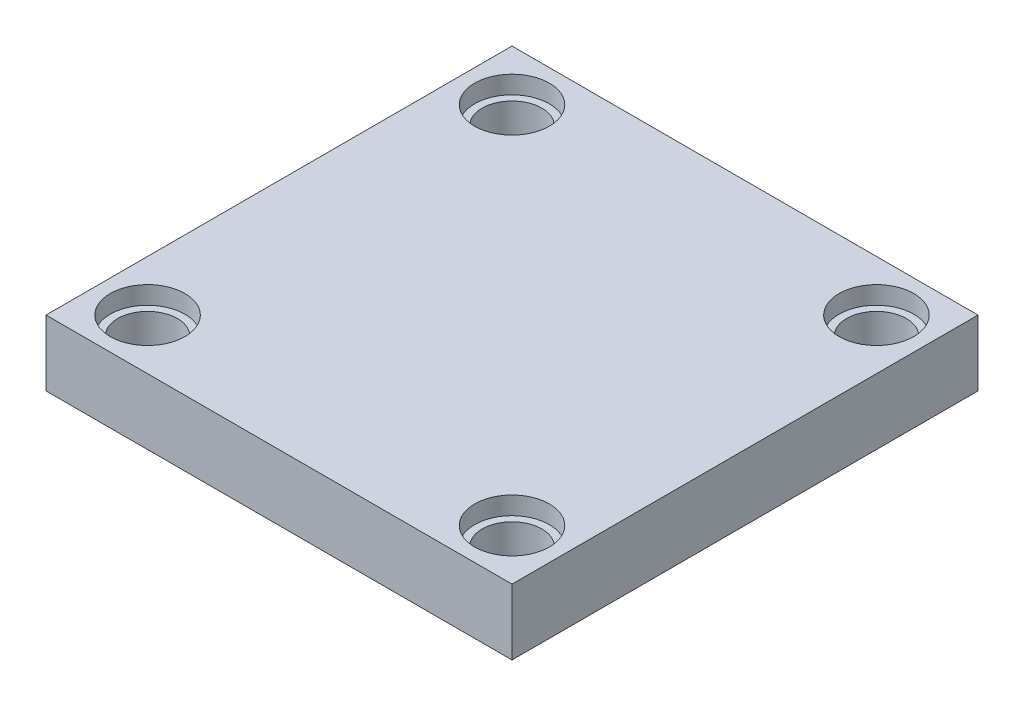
ISO-10303-21;
HEADER;
FILE_DESCRIPTION(('STEP AP214'),'2;1');
FILE_NAME('part.step','',(''),(''),'','','');
FILE_SCHEMA(('AUTOMOTIVE_DESIGN { 1 0 10303 214 1 1 1 1 }'));
ENDSEC;
DATA;
#1=APPLICATION_CONTEXT('core data for automotive mechanical design processes');
#2=APPLICATION_PROTOCOL_DEFINITION('international standard','automotive_design',2000,#1);
#3=PRODUCT_CONTEXT('',#1,'mechanical');
#4=PRODUCT('Part','Part','',(#3));
#5=PRODUCT_RELATED_PRODUCT_CATEGORY('part','',(#4));
#6=PRODUCT_DEFINITION_FORMATION('','',#4);
#7=PRODUCT_DEFINITION_CONTEXT('part definition',#1,'design');
#8=PRODUCT_DEFINITION('design','',#6,#7);
#9=PRODUCT_DEFINITION_SHAPE('','',#8);
#10=(LENGTH_UNIT() NAMED_UNIT(*) SI_UNIT(.MILLI.,.METRE.));
#11=(NAMED_UNIT(*) PLANE_ANGLE_UNIT() SI_UNIT($,.RADIAN.));
#12=(NAMED_UNIT(*) SI_UNIT($,.STERADIAN.) SOLID_ANGLE_UNIT());
#13=UNCERTAINTY_MEASURE_WITH_UNIT(LENGTH_MEASURE(1.E-05),#10,'distance_accuracy_value','');
#14=(GEOMETRIC_REPRESENTATION_CONTEXT(3) GLOBAL_UNCERTAINTY_ASSIGNED_CONTEXT((#13)) GLOBAL_UNIT_ASSIGNED_CONTEXT((#10,
#11,#12)) REPRESENTATION_CONTEXT('',''));
#15=CARTESIAN_POINT('',(0.,0.,0.));
#16=DIRECTION('',(0.,0.,1.));
#17=DIRECTION('',(1.,0.,0.));
#18=AXIS2_PLACEMENT_3D('',#15,#16,#17);
#19=CARTESIAN_POINT('',(61.,22.,61.));
#20=DIRECTION('',(0.,-1.,0.));
#21=DIRECTION('',(0.,0.,-1.));
#22=AXIS2_PLACEMENT_3D('',#19,#20,#21);
#23=CYLINDRICAL_SURFACE('',#22,9.99999999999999);
#24=CARTESIAN_POINT('',(61.,0.,61.));
#25=DIRECTION('',(0.,-1.,0.));
#26=DIRECTION('',(0.,0.,-1.));
#27=AXIS2_PLACEMENT_3D('',#24,#25,#26);
#28=CIRCLE('',#27,9.99999999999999);
#29=CARTESIAN_POINT('',(61.,0.,51.));
#30=VERTEX_POINT('',#29);
#31=EDGE_CURVE('E101',#30,#30,#28,.T.);
#32=ORIENTED_EDGE('',*,*,#31,.T.);
#33=EDGE_LOOP('',(#32));
#34=FACE_BOUND('',#33,.T.);
#35=CARTESIAN_POINT('',(61.,16.,61.));
#36=DIRECTION('',(0.,1.,0.));
#37=DIRECTION('',(0.,0.,1.));
#38=AXIS2_PLACEMENT_3D('',#35,#36,#37);
#39=CIRCLE('',#38,9.99999999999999);
#40=CARTESIAN_POINT('',(61.,16.,71.));
#41=VERTEX_POINT('',#40);
#42=EDGE_CURVE('E35',#41,#41,#39,.F.);
#43=ORIENTED_EDGE('',*,*,#42,.F.);
#44=EDGE_LOOP('',(#43));
#45=FACE_BOUND('',#44,.T.);
#46=ADVANCED_FACE('F31',(#34,#45),#23,.F.);
#47=CARTESIAN_POINT('',(-61.,22.,60.9999999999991));
#48=DIRECTION('',(0.,-1.,0.));
#49=DIRECTION('',(0.,0.,-1.));
#50=AXIS2_PLACEMENT_3D('',#47,#48,#49);
#51=CYLINDRICAL_SURFACE('',#50,9.99999999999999);
#52=CARTESIAN_POINT('',(-61.,0.,60.9999999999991));
#53=DIRECTION('',(0.,-1.,0.));
#54=DIRECTION('',(0.,0.,-1.));
#55=AXIS2_PLACEMENT_3D('',#52,#53,#54);
#56=CIRCLE('',#55,9.99999999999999);
#57=CARTESIAN_POINT('',(-61.,0.,50.9999999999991));
#58=VERTEX_POINT('',#57);
#59=EDGE_CURVE('E146',#58,#58,#56,.T.);
#60=ORIENTED_EDGE('',*,*,#59,.T.);
#61=EDGE_LOOP('',(#60));
#62=FACE_BOUND('',#61,.T.);
#63=CARTESIAN_POINT('',(-61.,16.,60.9999999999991));
#64=DIRECTION('',(0.,1.,0.));
#65=DIRECTION('',(0.,0.,1.));
#66=AXIS2_PLACEMENT_3D('',#63,#64,#65);
#67=CIRCLE('',#66,9.99999999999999);
#68=CARTESIAN_POINT('',(-61.,16.,70.9999999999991));
#69=VERTEX_POINT('',#68);
#70=EDGE_CURVE('E116',#69,#69,#67,.F.);
#71=ORIENTED_EDGE('',*,*,#70,.F.);
#72=EDGE_LOOP('',(#71));
#73=FACE_BOUND('',#72,.T.);
#74=ADVANCED_FACE('F174',(#62,#73),#51,.F.);
#75=CARTESIAN_POINT('',(61.0000000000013,22.,-61.));
#76=DIRECTION('',(0.,-1.,0.));
#77=DIRECTION('',(0.,0.,-1.));
#78=AXIS2_PLACEMENT_3D('',#75,#76,#77);
#79=CYLINDRICAL_SURFACE('',#78,9.99999999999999);
#80=CARTESIAN_POINT('',(61.0000000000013,0.,-61.));
#81=DIRECTION('',(0.,-1.,0.));
#82=DIRECTION('',(0.,0.,-1.));
#83=AXIS2_PLACEMENT_3D('',#80,#81,#82);
#84=CIRCLE('',#83,9.99999999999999);
#85=CARTESIAN_POINT('',(61.0000000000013,0.,-71.));
#86=VERTEX_POINT('',#85);
#87=EDGE_CURVE('E143',#86,#86,#84,.T.);
#88=ORIENTED_EDGE('',*,*,#87,.T.);
#89=EDGE_LOOP('',(#88));
#90=FACE_BOUND('',#89,.T.);
#91=CARTESIAN_POINT('',(61.0000000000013,16.,-61.));
#92=DIRECTION('',(0.,1.,0.));
#93=DIRECTION('',(0.,0.,1.));
#94=AXIS2_PLACEMENT_3D('',#91,#92,#93);
#95=CIRCLE('',#94,9.99999999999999);
#96=CARTESIAN_POINT('',(61.0000000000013,16.,-51.));
#97=VERTEX_POINT('',#96);
#98=EDGE_CURVE('E112',#97,#97,#95,.F.);
#99=ORIENTED_EDGE('',*,*,#98,.F.);
#100=EDGE_LOOP('',(#99));
#101=FACE_BOUND('',#100,.T.);
#102=ADVANCED_FACE('F180',(#90,#101),#79,.F.);
#103=CARTESIAN_POINT('',(-60.9999999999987,22.,-61.0000000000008));
#104=DIRECTION('',(0.,-1.,0.));
#105=DIRECTION('',(0.,0.,-1.));
#106=AXIS2_PLACEMENT_3D('',#103,#104,#105);
#107=CYLINDRICAL_SURFACE('',#106,9.99999999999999);
#108=CARTESIAN_POINT('',(-60.9999999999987,0.,-61.0000000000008));
#109=DIRECTION('',(0.,-1.,0.));
#110=DIRECTION('',(0.,0.,-1.));
#111=AXIS2_PLACEMENT_3D('',#108,#109,#110);
#112=CIRCLE('',#111,9.99999999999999);
#113=CARTESIAN_POINT('',(-60.9999999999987,0.,-71.0000000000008));
#114=VERTEX_POINT('',#113);
#115=EDGE_CURVE('E110',#114,#114,#112,.T.);
#116=ORIENTED_EDGE('',*,*,#115,.T.);
#117=EDGE_LOOP('',(#116));
#118=FACE_BOUND('',#117,.T.);
#119=CARTESIAN_POINT('',(-60.9999999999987,16.,-61.0000000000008));
#120=DIRECTION('',(0.,1.,0.));
#121=DIRECTION('',(0.,0.,1.));
#122=AXIS2_PLACEMENT_3D('',#119,#120,#121);
#123=CIRCLE('',#122,9.99999999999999);
#124=CARTESIAN_POINT('',(-60.9999999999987,16.,-51.0000000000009));
#125=VERTEX_POINT('',#124);
#126=EDGE_CURVE('E107',#125,#125,#123,.F.);
#127=ORIENTED_EDGE('',*,*,#126,.F.);
#128=EDGE_LOOP('',(#127));
#129=FACE_BOUND('',#128,.T.);
#130=ADVANCED_FACE('F186',(#118,#129),#107,.F.);
#131=CARTESIAN_POINT('',(78.,22.,78.));
#132=DIRECTION('',(-1.,0.,0.));
#133=DIRECTION('',(0.,0.,1.));
#134=AXIS2_PLACEMENT_3D('',#131,#132,#133);
#135=PLANE('',#134);
#136=DIRECTION('',(0.,0.,-1.));
#137=VECTOR('',#136,1.);
#138=CARTESIAN_POINT('',(78.,0.,78.));
#139=LINE('',#138,#137);
#140=CARTESIAN_POINT('',(78.,0.,78.));
#141=VERTEX_POINT('',#140);
#142=CARTESIAN_POINT('',(78.,0.,-78.));
#143=VERTEX_POINT('',#142);
#144=EDGE_CURVE('E98',#141,#143,#139,.T.);
#145=ORIENTED_EDGE('',*,*,#144,.T.);
#146=DIRECTION('',(0.,-1.,0.));
#147=VECTOR('',#146,1.);
#148=CARTESIAN_POINT('',(78.,22.,-78.));
#149=LINE('',#148,#147);
#150=CARTESIAN_POINT('',(78.,22.,-78.));
#151=VERTEX_POINT('',#150);
#152=EDGE_CURVE('E11',#151,#143,#149,.T.);
#153=ORIENTED_EDGE('',*,*,#152,.F.);
#154=DIRECTION('',(0.,0.,-1.));
#155=VECTOR('',#154,1.);
#156=CARTESIAN_POINT('',(78.,22.,78.));
#157=LINE('',#156,#155);
#158=CARTESIAN_POINT('',(78.,22.,78.));
#159=VERTEX_POINT('',#158);
#160=EDGE_CURVE('E85',#159,#151,#157,.T.);
#161=ORIENTED_EDGE('',*,*,#160,.F.);
#162=DIRECTION('',(0.,-1.,0.));
#163=VECTOR('',#162,1.);
#164=CARTESIAN_POINT('',(78.,22.,78.));
#165=LINE('',#164,#163);
#166=EDGE_CURVE('E94',#159,#141,#165,.T.);
#167=ORIENTED_EDGE('',*,*,#166,.T.);
#168=EDGE_LOOP('',(#145,#153,#161,#167));
#169=FACE_BOUND('',#168,.T.);
#170=ADVANCED_FACE('F33',(#169),#135,.F.);
#171=CARTESIAN_POINT('',(-78.,22.,-78.));
#172=DIRECTION('',(0.,0.,1.));
#173=DIRECTION('',(1.,0.,0.));
#174=AXIS2_PLACEMENT_3D('',#171,#172,#173);
#175=PLANE('',#174);
#176=DIRECTION('',(-1.,0.,0.));
#177=VECTOR('',#176,1.);
#178=CARTESIAN_POINT('',(-78.,0.,-78.));
#179=LINE('',#178,#177);
#180=CARTESIAN_POINT('',(-78.,0.,-78.));
#181=VERTEX_POINT('',#180);
#182=EDGE_CURVE('E89',#143,#181,#179,.T.);
#183=ORIENTED_EDGE('',*,*,#182,.T.);
#184=DIRECTION('',(0.,-1.,0.));
#185=VECTOR('',#184,1.);
#186=CARTESIAN_POINT('',(-78.,22.,-78.));
#187=LINE('',#186,#185);
#188=CARTESIAN_POINT('',(-78.,22.,-78.));
#189=VERTEX_POINT('',#188);
#190=EDGE_CURVE('E41',#189,#181,#187,.T.);
#191=ORIENTED_EDGE('',*,*,#190,.F.);
#192=DIRECTION('',(-1.,0.,0.));
#193=VECTOR('',#192,1.);
#194=CARTESIAN_POINT('',(-78.,22.,-78.));
#195=LINE('',#194,#193);
#196=EDGE_CURVE('E80',#151,#189,#195,.T.);
#197=ORIENTED_EDGE('',*,*,#196,.F.);
#198=ORIENTED_EDGE('',*,*,#152,.T.);
#199=EDGE_LOOP('',(#183,#191,#197,#198));
#200=FACE_BOUND('',#199,.T.);
#201=ADVANCED_FACE('F88',(#200),#175,.F.);
#202=CARTESIAN_POINT('',(-78.,22.,78.));
#203=DIRECTION('',(1.,0.,0.));
#204=DIRECTION('',(0.,0.,-1.));
#205=AXIS2_PLACEMENT_3D('',#202,#203,#204);
#206=PLANE('',#205);
#207=DIRECTION('',(0.,0.,1.));
#208=VECTOR('',#207,1.);
#209=CARTESIAN_POINT('',(-78.,0.,78.));
#210=LINE('',#209,#208);
#211=CARTESIAN_POINT('',(-78.,0.,78.));
#212=VERTEX_POINT('',#211);
#213=EDGE_CURVE('E67',#181,#212,#210,.T.);
#214=ORIENTED_EDGE('',*,*,#213,.T.);
#215=DIRECTION('',(0.,-1.,0.));
#216=VECTOR('',#215,1.);
#217=CARTESIAN_POINT('',(-78.,22.,78.));
#218=LINE('',#217,#216);
#219=CARTESIAN_POINT('',(-78.,22.,78.));
#220=VERTEX_POINT('',#219);
#221=EDGE_CURVE('E90',#220,#212,#218,.T.);
#222=ORIENTED_EDGE('',*,*,#221,.F.);
#223=DIRECTION('',(0.,0.,1.));
#224=VECTOR('',#223,1.);
#225=CARTESIAN_POINT('',(-78.,22.,78.));
#226=LINE('',#225,#224);
#227=EDGE_CURVE('E83',#189,#220,#226,.T.);
#228=ORIENTED_EDGE('',*,*,#227,.F.);
#229=ORIENTED_EDGE('',*,*,#190,.T.);
#230=EDGE_LOOP('',(#214,#222,#228,#229));
#231=FACE_BOUND('',#230,.T.);
#232=ADVANCED_FACE('F92',(#231),#206,.F.);
#233=CARTESIAN_POINT('',(-78.,22.,78.));
#234=DIRECTION('',(0.,0.,-1.));
#235=DIRECTION('',(-1.,0.,0.));
#236=AXIS2_PLACEMENT_3D('',#233,#234,#235);
#237=PLANE('',#236);
#238=DIRECTION('',(1.,0.,0.));
#239=VECTOR('',#238,1.);
#240=CARTESIAN_POINT('',(-78.,0.,78.));
#241=LINE('',#240,#239);
#242=EDGE_CURVE('E73',#212,#141,#241,.T.);
#243=ORIENTED_EDGE('',*,*,#242,.T.);
#244=ORIENTED_EDGE('',*,*,#166,.F.);
#245=DIRECTION('',(1.,0.,0.));
#246=VECTOR('',#245,1.);
#247=CARTESIAN_POINT('',(-78.,22.,78.));
#248=LINE('',#247,#246);
#249=EDGE_CURVE('E50',#220,#159,#248,.T.);
#250=ORIENTED_EDGE('',*,*,#249,.F.);
#251=ORIENTED_EDGE('',*,*,#221,.T.);
#252=EDGE_LOOP('',(#243,#244,#250,#251));
#253=FACE_BOUND('',#252,.T.);
#254=ADVANCED_FACE('F162',(#253),#237,.F.);
#255=CARTESIAN_POINT('',(78.,22.,-78.));
#256=DIRECTION('',(0.,-1.,0.));
#257=DIRECTION('',(0.,0.,-1.));
#258=AXIS2_PLACEMENT_3D('',#255,#256,#257);
#259=PLANE('',#258);
#260=CARTESIAN_POINT('',(61.0000000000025,22.,60.9999999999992));
#261=DIRECTION('',(0.,1.,0.));
#262=DIRECTION('',(0.,0.,1.));
#263=AXIS2_PLACEMENT_3D('',#260,#261,#262);
#264=CIRCLE('',#263,12.5);
#265=CARTESIAN_POINT('',(61.0000000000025,22.,73.4999999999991));
#266=VERTEX_POINT('',#265);
#267=EDGE_CURVE('E132',#266,#266,#264,.T.);
#268=ORIENTED_EDGE('',*,*,#267,.F.);
#269=EDGE_LOOP('',(#268));
#270=FACE_BOUND('',#269,.T.);
#271=CARTESIAN_POINT('',(-60.9999999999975,22.,60.9999999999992));
#272=DIRECTION('',(0.,1.,0.));
#273=DIRECTION('',(0.,0.,1.));
#274=AXIS2_PLACEMENT_3D('',#271,#272,#273);
#275=CIRCLE('',#274,12.5);
#276=CARTESIAN_POINT('',(-60.9999999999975,22.,73.4999999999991));
#277=VERTEX_POINT('',#276);
#278=EDGE_CURVE('E125',#277,#277,#275,.T.);
#279=ORIENTED_EDGE('',*,*,#278,.F.);
#280=EDGE_LOOP('',(#279));
#281=FACE_BOUND('',#280,.T.);
#282=CARTESIAN_POINT('',(61.0000000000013,22.,-61.0000000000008));
#283=DIRECTION('',(0.,1.,0.));
#284=DIRECTION('',(0.,0.,1.));
#285=AXIS2_PLACEMENT_3D('',#282,#283,#284);
#286=CIRCLE('',#285,12.5);
#287=CARTESIAN_POINT('',(61.0000000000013,22.,-48.5000000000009));
#288=VERTEX_POINT('',#287);
#289=EDGE_CURVE('E118',#288,#288,#286,.T.);
#290=ORIENTED_EDGE('',*,*,#289,.F.);
#291=EDGE_LOOP('',(#290));
#292=FACE_BOUND('',#291,.T.);
#293=CARTESIAN_POINT('',(-60.9999999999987,22.,-61.0000000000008));
#294=DIRECTION('',(0.,1.,0.));
#295=DIRECTION('',(0.,0.,1.));
#296=AXIS2_PLACEMENT_3D('',#293,#294,#295);
#297=CIRCLE('',#296,12.5);
#298=CARTESIAN_POINT('',(-60.9999999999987,22.,-48.5000000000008));
#299=VERTEX_POINT('',#298);
#300=EDGE_CURVE('E114',#299,#299,#297,.T.);
#301=ORIENTED_EDGE('',*,*,#300,.F.);
#302=EDGE_LOOP('',(#301));
#303=FACE_BOUND('',#302,.T.);
#304=ORIENTED_EDGE('',*,*,#160,.T.);
#305=ORIENTED_EDGE('',*,*,#196,.T.);
#306=ORIENTED_EDGE('',*,*,#227,.T.);
#307=ORIENTED_EDGE('',*,*,#249,.T.);
#308=EDGE_LOOP('',(#304,#305,#306,#307));
#309=FACE_BOUND('',#308,.T.);
#310=ADVANCED_FACE('F81',(#270,#281,#292,#303,#309),#259,.F.);
#311=CARTESIAN_POINT('',(78.,0.,-78.));
#312=DIRECTION('',(0.,-1.,0.));
#313=DIRECTION('',(0.,0.,-1.));
#314=AXIS2_PLACEMENT_3D('',#311,#312,#313);
#315=PLANE('',#314);
#316=ORIENTED_EDGE('',*,*,#115,.F.);
#317=EDGE_LOOP('',(#316));
#318=FACE_BOUND('',#317,.T.);
#319=ORIENTED_EDGE('',*,*,#87,.F.);
#320=EDGE_LOOP('',(#319));
#321=FACE_BOUND('',#320,.T.);
#322=ORIENTED_EDGE('',*,*,#59,.F.);
#323=EDGE_LOOP('',(#322));
#324=FACE_BOUND('',#323,.T.);
#325=ORIENTED_EDGE('',*,*,#31,.F.);
#326=EDGE_LOOP('',(#325));
#327=FACE_BOUND('',#326,.T.);
#328=ORIENTED_EDGE('',*,*,#144,.F.);
#329=ORIENTED_EDGE('',*,*,#242,.F.);
#330=ORIENTED_EDGE('',*,*,#213,.F.);
#331=ORIENTED_EDGE('',*,*,#182,.F.);
#332=EDGE_LOOP('',(#328,#329,#330,#331));
#333=FACE_BOUND('',#332,.T.);
#334=ADVANCED_FACE('F154',(#318,#321,#324,#327,#333),#315,.T.);
#335=CARTESIAN_POINT('',(-60.9999999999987,16.,-61.0000000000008));
#336=DIRECTION('',(0.,1.,0.));
#337=DIRECTION('',(0.,0.,1.));
#338=AXIS2_PLACEMENT_3D('',#335,#336,#337);
#339=PLANE('',#338);
#340=CARTESIAN_POINT('',(-60.9999999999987,16.,-61.0000000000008));
#341=DIRECTION('',(0.,1.,0.));
#342=DIRECTION('',(0.,0.,1.));
#343=AXIS2_PLACEMENT_3D('',#340,#341,#342);
#344=CIRCLE('',#343,12.5);
#345=CARTESIAN_POINT('',(-60.9999999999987,16.,-48.5000000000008));
#346=VERTEX_POINT('',#345);
#347=EDGE_CURVE('E111',#346,#346,#344,.T.);
#348=ORIENTED_EDGE('',*,*,#347,.T.);
#349=EDGE_LOOP('',(#348));
#350=FACE_BOUND('',#349,.T.);
#351=ORIENTED_EDGE('',*,*,#126,.T.);
#352=EDGE_LOOP('',(#351));
#353=FACE_BOUND('',#352,.T.);
#354=ADVANCED_FACE('F157',(#350,#353),#339,.T.);
#355=CARTESIAN_POINT('',(-60.9999999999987,16.,-61.0000000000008));
#356=DIRECTION('',(0.,1.,0.));
#357=DIRECTION('',(0.,0.,1.));
#358=AXIS2_PLACEMENT_3D('',#355,#356,#357);
#359=CYLINDRICAL_SURFACE('',#358,12.5);
#360=ORIENTED_EDGE('',*,*,#347,.F.);
#361=EDGE_LOOP('',(#360));
#362=FACE_BOUND('',#361,.T.);
#363=ORIENTED_EDGE('',*,*,#300,.T.);
#364=EDGE_LOOP('',(#363));
#365=FACE_BOUND('',#364,.T.);
#366=ADVANCED_FACE('F191',(#362,#365),#359,.F.);
#367=CARTESIAN_POINT('',(61.0000000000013,16.,-61.0000000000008));
#368=DIRECTION('',(0.,1.,0.));
#369=DIRECTION('',(0.,0.,1.));
#370=AXIS2_PLACEMENT_3D('',#367,#368,#369);
#371=PLANE('',#370);
#372=CARTESIAN_POINT('',(61.0000000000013,16.,-61.0000000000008));
#373=DIRECTION('',(0.,1.,0.));
#374=DIRECTION('',(0.,0.,1.));
#375=AXIS2_PLACEMENT_3D('',#372,#373,#374);
#376=CIRCLE('',#375,12.5);
#377=CARTESIAN_POINT('',(61.0000000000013,16.,-48.5000000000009));
#378=VERTEX_POINT('',#377);
#379=EDGE_CURVE('E115',#378,#378,#376,.T.);
#380=ORIENTED_EDGE('',*,*,#379,.T.);
#381=EDGE_LOOP('',(#380));
#382=FACE_BOUND('',#381,.T.);
#383=ORIENTED_EDGE('',*,*,#98,.T.);
#384=EDGE_LOOP('',(#383));
#385=FACE_BOUND('',#384,.T.);
#386=ADVANCED_FACE('F194',(#382,#385),#371,.T.);
#387=CARTESIAN_POINT('',(61.0000000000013,16.,-61.0000000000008));
#388=DIRECTION('',(0.,1.,0.));
#389=DIRECTION('',(0.,0.,1.));
#390=AXIS2_PLACEMENT_3D('',#387,#388,#389);
#391=CYLINDRICAL_SURFACE('',#390,12.5);
#392=ORIENTED_EDGE('',*,*,#379,.F.);
#393=EDGE_LOOP('',(#392));
#394=FACE_BOUND('',#393,.T.);
#395=ORIENTED_EDGE('',*,*,#289,.T.);
#396=EDGE_LOOP('',(#395));
#397=FACE_BOUND('',#396,.T.);
#398=ADVANCED_FACE('F199',(#394,#397),#391,.F.);
#399=CARTESIAN_POINT('',(-60.9999999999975,16.,60.9999999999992));
#400=DIRECTION('',(0.,1.,0.));
#401=DIRECTION('',(0.,0.,1.));
#402=AXIS2_PLACEMENT_3D('',#399,#400,#401);
#403=PLANE('',#402);
#404=CARTESIAN_POINT('',(-60.9999999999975,16.,60.9999999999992));
#405=DIRECTION('',(0.,1.,0.));
#406=DIRECTION('',(0.,0.,1.));
#407=AXIS2_PLACEMENT_3D('',#404,#405,#406);
#408=CIRCLE('',#407,12.5);
#409=CARTESIAN_POINT('',(-60.9999999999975,16.,73.4999999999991));
#410=VERTEX_POINT('',#409);
#411=EDGE_CURVE('E119',#410,#410,#408,.T.);
#412=ORIENTED_EDGE('',*,*,#411,.T.);
#413=EDGE_LOOP('',(#412));
#414=FACE_BOUND('',#413,.T.);
#415=ORIENTED_EDGE('',*,*,#70,.T.);
#416=EDGE_LOOP('',(#415));
#417=FACE_BOUND('',#416,.T.);
#418=ADVANCED_FACE('F202',(#414,#417),#403,.T.);
#419=CARTESIAN_POINT('',(-60.9999999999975,16.,60.9999999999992));
#420=DIRECTION('',(0.,1.,0.));
#421=DIRECTION('',(0.,0.,1.));
#422=AXIS2_PLACEMENT_3D('',#419,#420,#421);
#423=CYLINDRICAL_SURFACE('',#422,12.5);
#424=ORIENTED_EDGE('',*,*,#411,.F.);
#425=EDGE_LOOP('',(#424));
#426=FACE_BOUND('',#425,.T.);
#427=ORIENTED_EDGE('',*,*,#278,.T.);
#428=EDGE_LOOP('',(#427));
#429=FACE_BOUND('',#428,.T.);
#430=ADVANCED_FACE('F207',(#426,#429),#423,.F.);
#431=CARTESIAN_POINT('',(61.0000000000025,16.,60.9999999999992));
#432=DIRECTION('',(0.,1.,0.));
#433=DIRECTION('',(0.,0.,1.));
#434=AXIS2_PLACEMENT_3D('',#431,#432,#433);
#435=PLANE('',#434);
#436=CARTESIAN_POINT('',(61.0000000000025,16.,60.9999999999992));
#437=DIRECTION('',(0.,1.,0.));
#438=DIRECTION('',(0.,0.,1.));
#439=AXIS2_PLACEMENT_3D('',#436,#437,#438);
#440=CIRCLE('',#439,12.5);
#441=CARTESIAN_POINT('',(61.0000000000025,16.,73.4999999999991));
#442=VERTEX_POINT('',#441);
#443=EDGE_CURVE('E225',#442,#442,#440,.T.);
#444=ORIENTED_EDGE('',*,*,#443,.T.);
#445=EDGE_LOOP('',(#444));
#446=FACE_BOUND('',#445,.T.);
#447=ORIENTED_EDGE('',*,*,#42,.T.);
#448=EDGE_LOOP('',(#447));
#449=FACE_BOUND('',#448,.T.);
#450=ADVANCED_FACE('F210',(#446,#449),#435,.T.);
#451=CARTESIAN_POINT('',(61.0000000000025,16.,60.9999999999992));
#452=DIRECTION('',(0.,1.,0.));
#453=DIRECTION('',(0.,0.,1.));
#454=AXIS2_PLACEMENT_3D('',#451,#452,#453);
#455=CYLINDRICAL_SURFACE('',#454,12.5);
#456=ORIENTED_EDGE('',*,*,#443,.F.);
#457=EDGE_LOOP('',(#456));
#458=FACE_BOUND('',#457,.T.);
#459=ORIENTED_EDGE('',*,*,#267,.T.);
#460=EDGE_LOOP('',(#459));
#461=FACE_BOUND('',#460,.T.);
#462=ADVANCED_FACE('F214',(#458,#461),#455,.F.);
#463=CLOSED_SHELL('',(#46,#74,#102,#130,#170,#201,#232,#254,#310,#334,#354,#366,#386,#398,#418,
#430,#450,#462));
#464=MANIFOLD_SOLID_BREP('B2',#463);
#465=ADVANCED_BREP_SHAPE_REPRESENTATION('',(#18,#464),#14);
#466=SHAPE_DEFINITION_REPRESENTATION(#9,#465);
ENDSEC;
END-ISO-10303-21;
